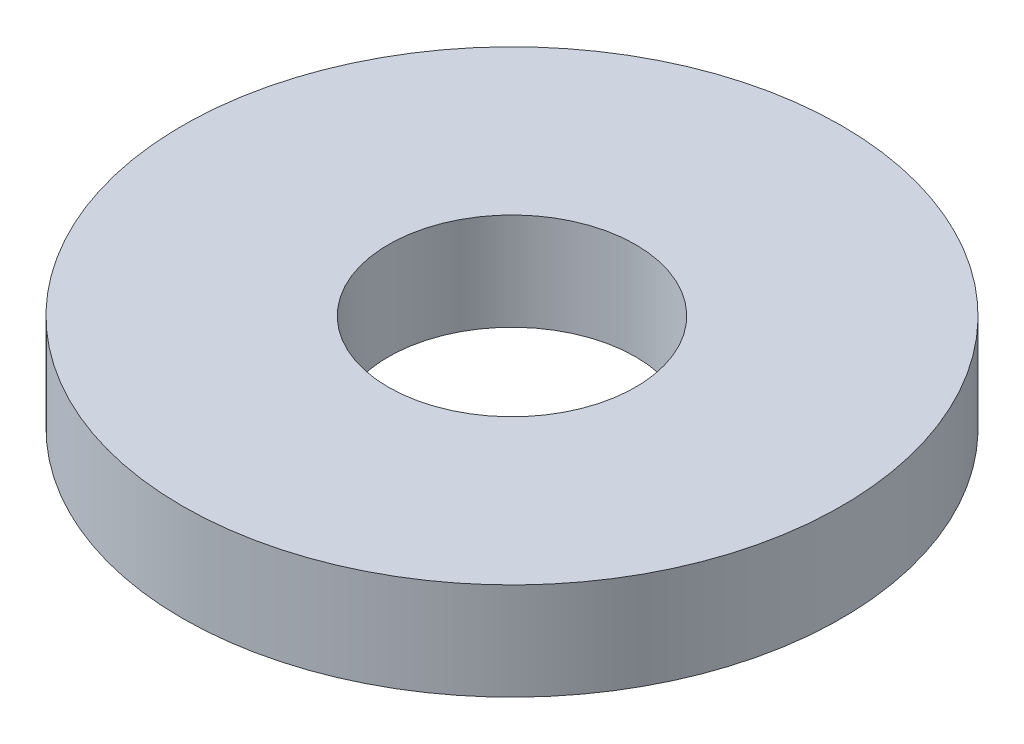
from build123d import *

# Parameters (mm, degrees)
SKETCH1_R           = 10.16
SKETCH1_R_2         = 3.81
BOSS_EXTRUDE1_DEPTH = 2.9972


with BuildPart() as part:
    # Sketch1 → Boss-Extrude1 (new body)
    with BuildSketch(Plane(origin=(0, 0, 0), x_dir=(1, 0, 0), z_dir=(0, 1, 0))):
        with Locations(Location((0, 0, 0), (0, 0, 90))):
            Circle(SKETCH1_R)
        with Locations(Location((0, 0, 0), (0, 0, 90))):
            Circle(SKETCH1_R_2, mode=Mode.SUBTRACT)
    extrude(amount=BOSS_EXTRUDE1_DEPTH)


solid = part.part
